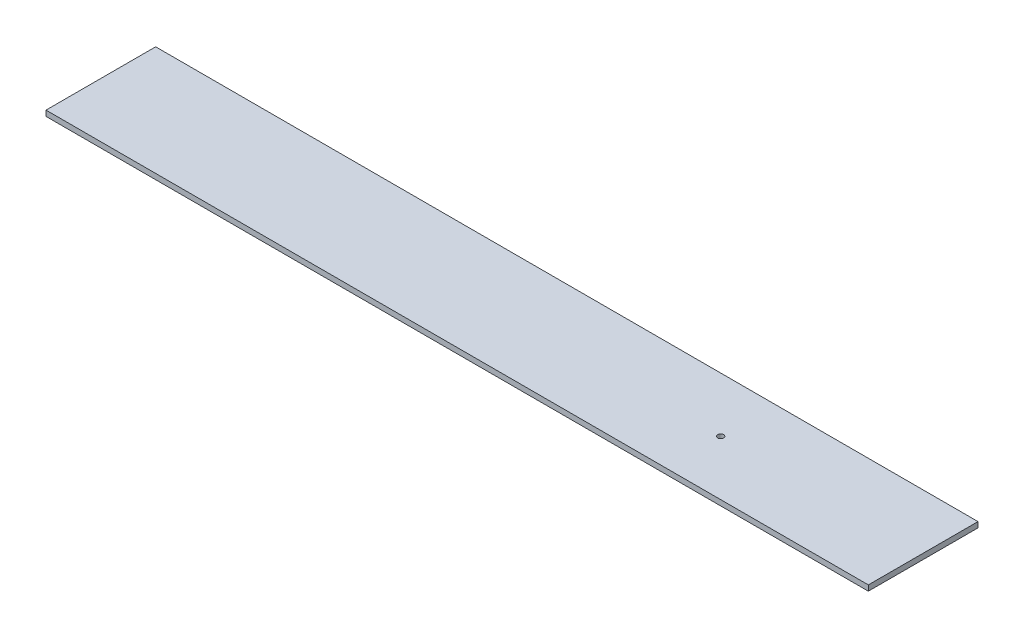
ISO-10303-21;
HEADER;
FILE_DESCRIPTION(('STEP AP214'),'2;1');
FILE_NAME('part.step','',(''),(''),'','','');
FILE_SCHEMA(('AUTOMOTIVE_DESIGN { 1 0 10303 214 1 1 1 1 }'));
ENDSEC;
DATA;
#1=APPLICATION_CONTEXT('core data for automotive mechanical design processes');
#2=APPLICATION_PROTOCOL_DEFINITION('international standard','automotive_design',2000,#1);
#3=PRODUCT_CONTEXT('',#1,'mechanical');
#4=PRODUCT('Part','Part','',(#3));
#5=PRODUCT_RELATED_PRODUCT_CATEGORY('part','',(#4));
#6=PRODUCT_DEFINITION_FORMATION('','',#4);
#7=PRODUCT_DEFINITION_CONTEXT('part definition',#1,'design');
#8=PRODUCT_DEFINITION('design','',#6,#7);
#9=PRODUCT_DEFINITION_SHAPE('','',#8);
#10=(LENGTH_UNIT() NAMED_UNIT(*) SI_UNIT(.MILLI.,.METRE.));
#11=(NAMED_UNIT(*) PLANE_ANGLE_UNIT() SI_UNIT($,.RADIAN.));
#12=(NAMED_UNIT(*) SI_UNIT($,.STERADIAN.) SOLID_ANGLE_UNIT());
#13=UNCERTAINTY_MEASURE_WITH_UNIT(LENGTH_MEASURE(1.E-05),#10,'distance_accuracy_value','');
#14=(GEOMETRIC_REPRESENTATION_CONTEXT(3) GLOBAL_UNCERTAINTY_ASSIGNED_CONTEXT((#13)) GLOBAL_UNIT_ASSIGNED_CONTEXT((#10,
#11,#12)) REPRESENTATION_CONTEXT('',''));
#15=CARTESIAN_POINT('',(0.,0.,0.));
#16=DIRECTION('',(0.,0.,1.));
#17=DIRECTION('',(1.,0.,0.));
#18=AXIS2_PLACEMENT_3D('',#15,#16,#17);
#19=CARTESIAN_POINT('',(-2499.99999999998,-100.,1000.));
#20=DIRECTION('',(-1.,0.,0.));
#21=DIRECTION('',(0.,0.,1.));
#22=AXIS2_PLACEMENT_3D('',#19,#20,#21);
#23=PLANE('',#22);
#24=DIRECTION('',(0.,0.,1.));
#25=VECTOR('',#24,1.);
#26=CARTESIAN_POINT('',(-2499.99999999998,0.,1000.));
#27=LINE('',#26,#25);
#28=CARTESIAN_POINT('',(-2499.99999999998,0.,-999.999999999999));
#29=VERTEX_POINT('',#28);
#30=CARTESIAN_POINT('',(-2499.99999999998,0.,1000.));
#31=VERTEX_POINT('',#30);
#32=EDGE_CURVE('E100',#29,#31,#27,.T.);
#33=ORIENTED_EDGE('',*,*,#32,.F.);
#34=DIRECTION('',(0.,1.,0.));
#35=VECTOR('',#34,1.);
#36=CARTESIAN_POINT('',(-2499.99999999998,-100.,-999.999999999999));
#37=LINE('',#36,#35);
#38=CARTESIAN_POINT('',(-2499.99999999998,-100.,-999.999999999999));
#39=VERTEX_POINT('',#38);
#40=EDGE_CURVE('E11',#39,#29,#37,.T.);
#41=ORIENTED_EDGE('',*,*,#40,.F.);
#42=DIRECTION('',(0.,0.,1.));
#43=VECTOR('',#42,1.);
#44=CARTESIAN_POINT('',(-2499.99999999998,-100.,1000.));
#45=LINE('',#44,#43);
#46=CARTESIAN_POINT('',(-2499.99999999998,-100.,1000.));
#47=VERTEX_POINT('',#46);
#48=EDGE_CURVE('E93',#39,#47,#45,.T.);
#49=ORIENTED_EDGE('',*,*,#48,.T.);
#50=DIRECTION('',(0.,1.,0.));
#51=VECTOR('',#50,1.);
#52=CARTESIAN_POINT('',(-2499.99999999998,-100.,1000.));
#53=LINE('',#52,#51);
#54=EDGE_CURVE('E38',#47,#31,#53,.T.);
#55=ORIENTED_EDGE('',*,*,#54,.T.);
#56=EDGE_LOOP('',(#33,#41,#49,#55));
#57=FACE_BOUND('',#56,.T.);
#58=ADVANCED_FACE('F35',(#57),#23,.T.);
#59=CARTESIAN_POINT('',(12500.,-100.,-1000.));
#60=DIRECTION('',(0.,0.,-1.));
#61=DIRECTION('',(-1.,0.,0.));
#62=AXIS2_PLACEMENT_3D('',#59,#60,#61);
#63=PLANE('',#62);
#64=DIRECTION('',(-1.,0.,0.));
#65=VECTOR('',#64,1.);
#66=CARTESIAN_POINT('',(12500.,0.,-1000.));
#67=LINE('',#66,#65);
#68=CARTESIAN_POINT('',(12500.,0.,-1000.));
#69=VERTEX_POINT('',#68);
#70=EDGE_CURVE('E95',#69,#29,#67,.T.);
#71=ORIENTED_EDGE('',*,*,#70,.F.);
#72=DIRECTION('',(0.,1.,0.));
#73=VECTOR('',#72,1.);
#74=CARTESIAN_POINT('',(12500.,-100.,-1000.));
#75=LINE('',#74,#73);
#76=CARTESIAN_POINT('',(12500.,-100.,-1000.));
#77=VERTEX_POINT('',#76);
#78=EDGE_CURVE('E44',#77,#69,#75,.T.);
#79=ORIENTED_EDGE('',*,*,#78,.F.);
#80=DIRECTION('',(-1.,0.,0.));
#81=VECTOR('',#80,1.);
#82=CARTESIAN_POINT('',(12500.,-100.,-1000.));
#83=LINE('',#82,#81);
#84=EDGE_CURVE('E90',#77,#39,#83,.T.);
#85=ORIENTED_EDGE('',*,*,#84,.T.);
#86=ORIENTED_EDGE('',*,*,#40,.T.);
#87=EDGE_LOOP('',(#71,#79,#85,#86));
#88=FACE_BOUND('',#87,.T.);
#89=ADVANCED_FACE('F111',(#88),#63,.T.);
#90=CARTESIAN_POINT('',(12500.,-100.,999.999999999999));
#91=DIRECTION('',(1.,0.,0.));
#92=DIRECTION('',(0.,0.,-1.));
#93=AXIS2_PLACEMENT_3D('',#90,#91,#92);
#94=PLANE('',#93);
#95=DIRECTION('',(0.,0.,-1.));
#96=VECTOR('',#95,1.);
#97=CARTESIAN_POINT('',(12500.,0.,999.999999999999));
#98=LINE('',#97,#96);
#99=CARTESIAN_POINT('',(12500.,0.,999.999999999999));
#100=VERTEX_POINT('',#99);
#101=EDGE_CURVE('E85',#100,#69,#98,.T.);
#102=ORIENTED_EDGE('',*,*,#101,.F.);
#103=DIRECTION('',(0.,1.,0.));
#104=VECTOR('',#103,1.);
#105=CARTESIAN_POINT('',(12500.,-100.,999.999999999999));
#106=LINE('',#105,#104);
#107=CARTESIAN_POINT('',(12500.,-100.,999.999999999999));
#108=VERTEX_POINT('',#107);
#109=EDGE_CURVE('E80',#108,#100,#106,.T.);
#110=ORIENTED_EDGE('',*,*,#109,.F.);
#111=DIRECTION('',(0.,0.,-1.));
#112=VECTOR('',#111,1.);
#113=CARTESIAN_POINT('',(12500.,-100.,999.999999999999));
#114=LINE('',#113,#112);
#115=EDGE_CURVE('E83',#108,#77,#114,.T.);
#116=ORIENTED_EDGE('',*,*,#115,.T.);
#117=ORIENTED_EDGE('',*,*,#78,.T.);
#118=EDGE_LOOP('',(#102,#110,#116,#117));
#119=FACE_BOUND('',#118,.T.);
#120=ADVANCED_FACE('F82',(#119),#94,.T.);
#121=CARTESIAN_POINT('',(12500.,-100.,999.999999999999));
#122=DIRECTION('',(0.,0.,1.));
#123=DIRECTION('',(1.,0.,0.));
#124=AXIS2_PLACEMENT_3D('',#121,#122,#123);
#125=PLANE('',#124);
#126=DIRECTION('',(1.,0.,0.));
#127=VECTOR('',#126,1.);
#128=CARTESIAN_POINT('',(12500.,0.,999.999999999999));
#129=LINE('',#128,#127);
#130=EDGE_CURVE('E103',#31,#100,#129,.T.);
#131=ORIENTED_EDGE('',*,*,#130,.F.);
#132=ORIENTED_EDGE('',*,*,#54,.F.);
#133=DIRECTION('',(1.,0.,0.));
#134=VECTOR('',#133,1.);
#135=CARTESIAN_POINT('',(12500.,-100.,999.999999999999));
#136=LINE('',#135,#134);
#137=EDGE_CURVE('E89',#47,#108,#136,.T.);
#138=ORIENTED_EDGE('',*,*,#137,.T.);
#139=ORIENTED_EDGE('',*,*,#109,.T.);
#140=EDGE_LOOP('',(#131,#132,#138,#139));
#141=FACE_BOUND('',#140,.T.);
#142=ADVANCED_FACE('F92',(#141),#125,.T.);
#143=CARTESIAN_POINT('',(0.,-100.,0.));
#144=DIRECTION('',(0.,1.,0.));
#145=DIRECTION('',(0.,0.,1.));
#146=AXIS2_PLACEMENT_3D('',#143,#144,#145);
#147=PLANE('',#146);
#148=CARTESIAN_POINT('',(8806.33999999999,-100.,0.000395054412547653));
#149=DIRECTION('',(0.,1.,0.));
#150=DIRECTION('',(0.,0.,1.));
#151=AXIS2_PLACEMENT_3D('',#148,#149,#150);
#152=CIRCLE('',#151,53.9749999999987);
#153=CARTESIAN_POINT('',(8806.33999999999,-100.,53.9753950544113));
#154=VERTEX_POINT('',#153);
#155=EDGE_CURVE('E104',#154,#154,#152,.T.);
#156=ORIENTED_EDGE('',*,*,#155,.T.);
#157=EDGE_LOOP('',(#156));
#158=FACE_BOUND('',#157,.T.);
#159=ORIENTED_EDGE('',*,*,#48,.F.);
#160=ORIENTED_EDGE('',*,*,#84,.F.);
#161=ORIENTED_EDGE('',*,*,#115,.F.);
#162=ORIENTED_EDGE('',*,*,#137,.F.);
#163=EDGE_LOOP('',(#159,#160,#161,#162));
#164=FACE_BOUND('',#163,.T.);
#165=ADVANCED_FACE('F88',(#158,#164),#147,.F.);
#166=CARTESIAN_POINT('',(0.,0.,0.));
#167=DIRECTION('',(0.,1.,0.));
#168=DIRECTION('',(0.,0.,1.));
#169=AXIS2_PLACEMENT_3D('',#166,#167,#168);
#170=PLANE('',#169);
#171=CARTESIAN_POINT('',(-193.66,0.,-2.28983498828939E-13));
#172=DIRECTION('',(0.,1.,0.));
#173=DIRECTION('',(0.,0.,1.));
#174=AXIS2_PLACEMENT_3D('',#171,#172,#173);
#175=CIRCLE('',#174,3.99999999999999);
#176=CARTESIAN_POINT('',(-193.66,0.,3.99999999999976));
#177=VERTEX_POINT('',#176);
#178=EDGE_CURVE('E149',#177,#177,#175,.T.);
#179=ORIENTED_EDGE('',*,*,#178,.F.);
#180=EDGE_LOOP('',(#179));
#181=FACE_BOUND('',#180,.T.);
#182=CARTESIAN_POINT('',(8806.33999999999,0.,0.000395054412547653));
#183=DIRECTION('',(0.,1.,0.));
#184=DIRECTION('',(0.,0.,1.));
#185=AXIS2_PLACEMENT_3D('',#182,#183,#184);
#186=CIRCLE('',#185,53.9749999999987);
#187=CARTESIAN_POINT('',(8806.33999999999,0.,53.9753950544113));
#188=VERTEX_POINT('',#187);
#189=EDGE_CURVE('E148',#188,#188,#186,.T.);
#190=ORIENTED_EDGE('',*,*,#189,.F.);
#191=EDGE_LOOP('',(#190));
#192=FACE_BOUND('',#191,.T.);
#193=ORIENTED_EDGE('',*,*,#32,.T.);
#194=ORIENTED_EDGE('',*,*,#130,.T.);
#195=ORIENTED_EDGE('',*,*,#101,.T.);
#196=ORIENTED_EDGE('',*,*,#70,.T.);
#197=EDGE_LOOP('',(#193,#194,#195,#196));
#198=FACE_BOUND('',#197,.T.);
#199=ADVANCED_FACE('F110',(#181,#192,#198),#170,.T.);
#200=CARTESIAN_POINT('',(8806.33999999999,-110.,0.000395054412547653));
#201=DIRECTION('',(0.,1.,0.));
#202=DIRECTION('',(0.,0.,1.));
#203=AXIS2_PLACEMENT_3D('',#200,#201,#202);
#204=CYLINDRICAL_SURFACE('',#203,53.9749999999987);
#205=ORIENTED_EDGE('',*,*,#189,.T.);
#206=EDGE_LOOP('',(#205));
#207=FACE_BOUND('',#206,.T.);
#208=ORIENTED_EDGE('',*,*,#155,.F.);
#209=EDGE_LOOP('',(#208));
#210=FACE_BOUND('',#209,.T.);
#211=ADVANCED_FACE('F129',(#207,#210),#204,.F.);
#212=CARTESIAN_POINT('',(-193.66,-43.6,-2.28983498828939E-13));
#213=DIRECTION('',(0.,1.,0.));
#214=DIRECTION('',(0.,0.,1.));
#215=AXIS2_PLACEMENT_3D('',#212,#213,#214);
#216=CYLINDRICAL_SURFACE('',#215,3.99999999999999);
#217=CARTESIAN_POINT('',(-193.66,-43.6,-2.28983498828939E-13));
#218=DIRECTION('',(0.,1.,0.));
#219=DIRECTION('',(0.,0.,1.));
#220=AXIS2_PLACEMENT_3D('',#217,#218,#219);
#221=CIRCLE('',#220,3.99999999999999);
#222=CARTESIAN_POINT('',(-193.66,-43.6,3.99999999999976));
#223=VERTEX_POINT('',#222);
#224=EDGE_CURVE('E147',#223,#223,#221,.T.);
#225=ORIENTED_EDGE('',*,*,#224,.F.);
#226=EDGE_LOOP('',(#225));
#227=FACE_BOUND('',#226,.T.);
#228=ORIENTED_EDGE('',*,*,#178,.T.);
#229=EDGE_LOOP('',(#228));
#230=FACE_BOUND('',#229,.T.);
#231=ADVANCED_FACE('F135',(#227,#230),#216,.F.);
#232=CARTESIAN_POINT('',(-193.66,-43.6,-2.28983498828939E-13));
#233=DIRECTION('',(0.,1.,0.));
#234=DIRECTION('',(0.,0.,1.));
#235=AXIS2_PLACEMENT_3D('',#232,#233,#234);
#236=PLANE('',#235);
#237=ORIENTED_EDGE('',*,*,#224,.T.);
#238=EDGE_LOOP('',(#237));
#239=FACE_BOUND('',#238,.T.);
#240=ADVANCED_FACE('F139',(#239),#236,.T.);
#241=CLOSED_SHELL('',(#58,#89,#120,#142,#165,#199,#211,#231,#240));
#242=MANIFOLD_SOLID_BREP('B2',#241);
#243=ADVANCED_BREP_SHAPE_REPRESENTATION('',(#18,#242),#14);
#244=SHAPE_DEFINITION_REPRESENTATION(#9,#243);
ENDSEC;
END-ISO-10303-21;
